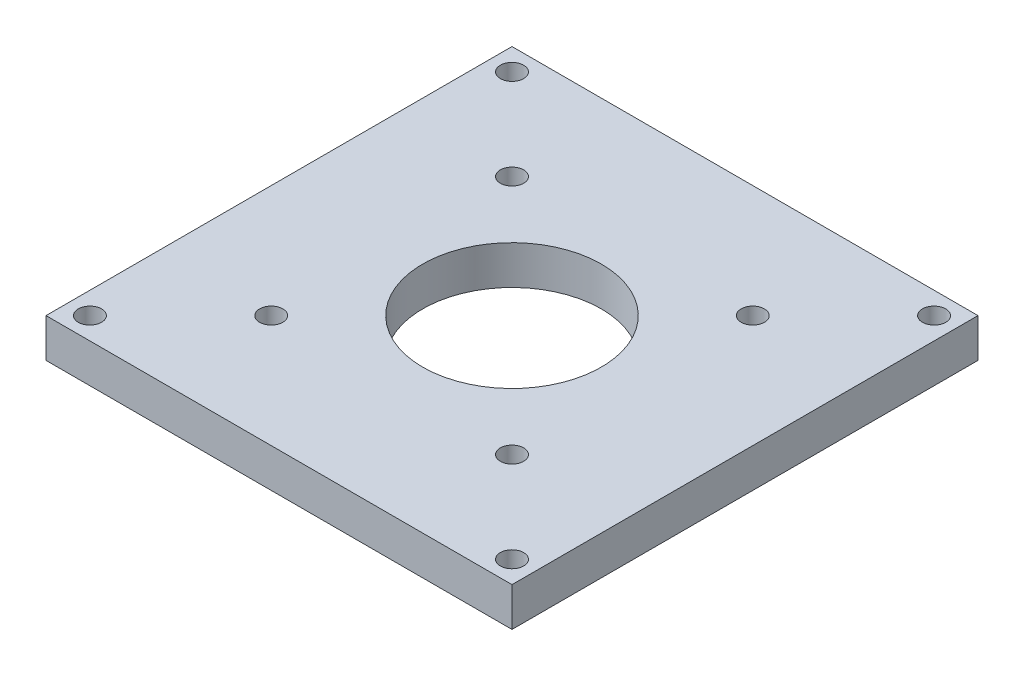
ISO-10303-21;
HEADER;
FILE_DESCRIPTION(('STEP AP214'),'2;1');
FILE_NAME('part.step','',(''),(''),'','','');
FILE_SCHEMA(('AUTOMOTIVE_DESIGN { 1 0 10303 214 1 1 1 1 }'));
ENDSEC;
DATA;
#1=APPLICATION_CONTEXT('core data for automotive mechanical design processes');
#2=APPLICATION_PROTOCOL_DEFINITION('international standard','automotive_design',2000,#1);
#3=PRODUCT_CONTEXT('',#1,'mechanical');
#4=PRODUCT('Part','Part','',(#3));
#5=PRODUCT_RELATED_PRODUCT_CATEGORY('part','',(#4));
#6=PRODUCT_DEFINITION_FORMATION('','',#4);
#7=PRODUCT_DEFINITION_CONTEXT('part definition',#1,'design');
#8=PRODUCT_DEFINITION('design','',#6,#7);
#9=PRODUCT_DEFINITION_SHAPE('','',#8);
#10=(LENGTH_UNIT() NAMED_UNIT(*) SI_UNIT(.MILLI.,.METRE.));
#11=(NAMED_UNIT(*) PLANE_ANGLE_UNIT() SI_UNIT($,.RADIAN.));
#12=(NAMED_UNIT(*) SI_UNIT($,.STERADIAN.) SOLID_ANGLE_UNIT());
#13=UNCERTAINTY_MEASURE_WITH_UNIT(LENGTH_MEASURE(1.E-05),#10,'distance_accuracy_value','');
#14=(GEOMETRIC_REPRESENTATION_CONTEXT(3) GLOBAL_UNCERTAINTY_ASSIGNED_CONTEXT((#13)) GLOBAL_UNIT_ASSIGNED_CONTEXT((#10,
#11,#12)) REPRESENTATION_CONTEXT('',''));
#15=CARTESIAN_POINT('',(0.,0.,0.));
#16=DIRECTION('',(0.,0.,1.));
#17=DIRECTION('',(1.,0.,0.));
#18=AXIS2_PLACEMENT_3D('',#15,#16,#17);
#19=CARTESIAN_POINT('',(0.,5.,0.));
#20=DIRECTION('',(1.,0.,0.));
#21=DIRECTION('',(0.,0.,-1.));
#22=AXIS2_PLACEMENT_3D('',#19,#20,#21);
#23=PLANE('',#22);
#24=DIRECTION('',(0.,0.,1.));
#25=VECTOR('',#24,1.);
#26=CARTESIAN_POINT('',(0.,0.,0.));
#27=LINE('',#26,#25);
#28=CARTESIAN_POINT('',(0.,0.,-60.));
#29=VERTEX_POINT('',#28);
#30=CARTESIAN_POINT('',(0.,0.,0.));
#31=VERTEX_POINT('',#30);
#32=EDGE_CURVE('E99',#29,#31,#27,.T.);
#33=ORIENTED_EDGE('',*,*,#32,.T.);
#34=DIRECTION('',(0.,-1.,0.));
#35=VECTOR('',#34,1.);
#36=CARTESIAN_POINT('',(0.,5.,0.));
#37=LINE('',#36,#35);
#38=CARTESIAN_POINT('',(0.,5.,0.));
#39=VERTEX_POINT('',#38);
#40=EDGE_CURVE('E11',#39,#31,#37,.T.);
#41=ORIENTED_EDGE('',*,*,#40,.F.);
#42=DIRECTION('',(0.,0.,1.));
#43=VECTOR('',#42,1.);
#44=CARTESIAN_POINT('',(0.,5.,0.));
#45=LINE('',#44,#43);
#46=CARTESIAN_POINT('',(0.,5.,-60.));
#47=VERTEX_POINT('',#46);
#48=EDGE_CURVE('E87',#47,#39,#45,.T.);
#49=ORIENTED_EDGE('',*,*,#48,.F.);
#50=DIRECTION('',(0.,-1.,0.));
#51=VECTOR('',#50,1.);
#52=CARTESIAN_POINT('',(0.,5.,-60.));
#53=LINE('',#52,#51);
#54=EDGE_CURVE('E95',#47,#29,#53,.T.);
#55=ORIENTED_EDGE('',*,*,#54,.T.);
#56=EDGE_LOOP('',(#33,#41,#49,#55));
#57=FACE_BOUND('',#56,.T.);
#58=ADVANCED_FACE('F36',(#57),#23,.F.);
#59=CARTESIAN_POINT('',(0.,5.,0.));
#60=DIRECTION('',(0.,0.,-1.));
#61=DIRECTION('',(-1.,0.,0.));
#62=AXIS2_PLACEMENT_3D('',#59,#60,#61);
#63=PLANE('',#62);
#64=DIRECTION('',(1.,0.,0.));
#65=VECTOR('',#64,1.);
#66=CARTESIAN_POINT('',(0.,0.,0.));
#67=LINE('',#66,#65);
#68=CARTESIAN_POINT('',(60.,0.,0.));
#69=VERTEX_POINT('',#68);
#70=EDGE_CURVE('E91',#31,#69,#67,.T.);
#71=ORIENTED_EDGE('',*,*,#70,.T.);
#72=DIRECTION('',(0.,-1.,0.));
#73=VECTOR('',#72,1.);
#74=CARTESIAN_POINT('',(60.,5.,0.));
#75=LINE('',#74,#73);
#76=CARTESIAN_POINT('',(60.,5.,0.));
#77=VERTEX_POINT('',#76);
#78=EDGE_CURVE('E44',#77,#69,#75,.T.);
#79=ORIENTED_EDGE('',*,*,#78,.F.);
#80=DIRECTION('',(1.,0.,0.));
#81=VECTOR('',#80,1.);
#82=CARTESIAN_POINT('',(0.,5.,0.));
#83=LINE('',#82,#81);
#84=EDGE_CURVE('E82',#39,#77,#83,.T.);
#85=ORIENTED_EDGE('',*,*,#84,.F.);
#86=ORIENTED_EDGE('',*,*,#40,.T.);
#87=EDGE_LOOP('',(#71,#79,#85,#86));
#88=FACE_BOUND('',#87,.T.);
#89=ADVANCED_FACE('F90',(#88),#63,.F.);
#90=CARTESIAN_POINT('',(60.,5.,0.));
#91=DIRECTION('',(-1.,0.,0.));
#92=DIRECTION('',(0.,0.,1.));
#93=AXIS2_PLACEMENT_3D('',#90,#91,#92);
#94=PLANE('',#93);
#95=DIRECTION('',(0.,0.,-1.));
#96=VECTOR('',#95,1.);
#97=CARTESIAN_POINT('',(60.,0.,0.));
#98=LINE('',#97,#96);
#99=CARTESIAN_POINT('',(60.,0.,-60.));
#100=VERTEX_POINT('',#99);
#101=EDGE_CURVE('E69',#69,#100,#98,.T.);
#102=ORIENTED_EDGE('',*,*,#101,.T.);
#103=DIRECTION('',(0.,-1.,0.));
#104=VECTOR('',#103,1.);
#105=CARTESIAN_POINT('',(60.,5.,-60.));
#106=LINE('',#105,#104);
#107=CARTESIAN_POINT('',(60.,5.,-60.));
#108=VERTEX_POINT('',#107);
#109=EDGE_CURVE('E92',#108,#100,#106,.T.);
#110=ORIENTED_EDGE('',*,*,#109,.F.);
#111=DIRECTION('',(0.,0.,-1.));
#112=VECTOR('',#111,1.);
#113=CARTESIAN_POINT('',(60.,5.,0.));
#114=LINE('',#113,#112);
#115=EDGE_CURVE('E85',#77,#108,#114,.T.);
#116=ORIENTED_EDGE('',*,*,#115,.F.);
#117=ORIENTED_EDGE('',*,*,#78,.T.);
#118=EDGE_LOOP('',(#102,#110,#116,#117));
#119=FACE_BOUND('',#118,.T.);
#120=ADVANCED_FACE('F93',(#119),#94,.F.);
#121=CARTESIAN_POINT('',(0.,5.,-60.));
#122=DIRECTION('',(0.,0.,1.));
#123=DIRECTION('',(1.,0.,0.));
#124=AXIS2_PLACEMENT_3D('',#121,#122,#123);
#125=PLANE('',#124);
#126=DIRECTION('',(-1.,0.,0.));
#127=VECTOR('',#126,1.);
#128=CARTESIAN_POINT('',(0.,0.,-60.));
#129=LINE('',#128,#127);
#130=EDGE_CURVE('E75',#100,#29,#129,.T.);
#131=ORIENTED_EDGE('',*,*,#130,.T.);
#132=ORIENTED_EDGE('',*,*,#54,.F.);
#133=DIRECTION('',(-1.,0.,0.));
#134=VECTOR('',#133,1.);
#135=CARTESIAN_POINT('',(0.,5.,-60.));
#136=LINE('',#135,#134);
#137=EDGE_CURVE('E52',#108,#47,#136,.T.);
#138=ORIENTED_EDGE('',*,*,#137,.F.);
#139=ORIENTED_EDGE('',*,*,#109,.T.);
#140=EDGE_LOOP('',(#131,#132,#138,#139));
#141=FACE_BOUND('',#140,.T.);
#142=ADVANCED_FACE('F107',(#141),#125,.F.);
#143=CARTESIAN_POINT('',(0.,5.,0.));
#144=DIRECTION('',(0.,-1.,0.));
#145=DIRECTION('',(0.,0.,-1.));
#146=AXIS2_PLACEMENT_3D('',#143,#144,#145);
#147=PLANE('',#146);
#148=CARTESIAN_POINT('',(14.5,5.,-45.5));
#149=DIRECTION('',(0.,1.,0.));
#150=DIRECTION('',(0.,0.,1.));
#151=AXIS2_PLACEMENT_3D('',#148,#149,#150);
#152=CIRCLE('',#151,1.5);
#153=CARTESIAN_POINT('',(14.5,5.,-44.));
#154=VERTEX_POINT('',#153);
#155=EDGE_CURVE('E138',#154,#154,#152,.T.);
#156=ORIENTED_EDGE('',*,*,#155,.F.);
#157=EDGE_LOOP('',(#156));
#158=FACE_BOUND('',#157,.T.);
#159=CARTESIAN_POINT('',(45.5,5.,-45.5));
#160=DIRECTION('',(0.,1.,0.));
#161=DIRECTION('',(0.,0.,1.));
#162=AXIS2_PLACEMENT_3D('',#159,#160,#161);
#163=CIRCLE('',#162,1.5);
#164=CARTESIAN_POINT('',(45.5,5.,-44.));
#165=VERTEX_POINT('',#164);
#166=EDGE_CURVE('E132',#165,#165,#163,.T.);
#167=ORIENTED_EDGE('',*,*,#166,.F.);
#168=EDGE_LOOP('',(#167));
#169=FACE_BOUND('',#168,.T.);
#170=CARTESIAN_POINT('',(45.5,5.,-14.5));
#171=DIRECTION('',(0.,1.,0.));
#172=DIRECTION('',(0.,0.,1.));
#173=AXIS2_PLACEMENT_3D('',#170,#171,#172);
#174=CIRCLE('',#173,1.5);
#175=CARTESIAN_POINT('',(45.5,5.,-13.));
#176=VERTEX_POINT('',#175);
#177=EDGE_CURVE('E126',#176,#176,#174,.T.);
#178=ORIENTED_EDGE('',*,*,#177,.F.);
#179=EDGE_LOOP('',(#178));
#180=FACE_BOUND('',#179,.T.);
#181=CARTESIAN_POINT('',(14.5,5.,-14.5));
#182=DIRECTION('',(0.,1.,0.));
#183=DIRECTION('',(0.,0.,1.));
#184=AXIS2_PLACEMENT_3D('',#181,#182,#183);
#185=CIRCLE('',#184,1.5);
#186=CARTESIAN_POINT('',(14.5,5.,-13.));
#187=VERTEX_POINT('',#186);
#188=EDGE_CURVE('E119',#187,#187,#185,.T.);
#189=ORIENTED_EDGE('',*,*,#188,.F.);
#190=EDGE_LOOP('',(#189));
#191=FACE_BOUND('',#190,.T.);
#192=CARTESIAN_POINT('',(2.82842712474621,5.,-57.1715728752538));
#193=DIRECTION('',(0.,1.,0.));
#194=DIRECTION('',(0.,0.,1.));
#195=AXIS2_PLACEMENT_3D('',#192,#193,#194);
#196=CIRCLE('',#195,1.49999999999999);
#197=CARTESIAN_POINT('',(2.82842712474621,5.,-55.6715728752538));
#198=VERTEX_POINT('',#197);
#199=EDGE_CURVE('E161',#198,#198,#196,.T.);
#200=ORIENTED_EDGE('',*,*,#199,.F.);
#201=EDGE_LOOP('',(#200));
#202=FACE_BOUND('',#201,.T.);
#203=CARTESIAN_POINT('',(57.1715728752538,5.,-57.1715728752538));
#204=DIRECTION('',(0.,1.,0.));
#205=DIRECTION('',(0.,0.,1.));
#206=AXIS2_PLACEMENT_3D('',#203,#204,#205);
#207=CIRCLE('',#206,1.5);
#208=CARTESIAN_POINT('',(57.1715728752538,5.,-55.6715728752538));
#209=VERTEX_POINT('',#208);
#210=EDGE_CURVE('E155',#209,#209,#207,.T.);
#211=ORIENTED_EDGE('',*,*,#210,.F.);
#212=EDGE_LOOP('',(#211));
#213=FACE_BOUND('',#212,.T.);
#214=CARTESIAN_POINT('',(57.1715728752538,5.,-2.82842712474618));
#215=DIRECTION('',(0.,1.,0.));
#216=DIRECTION('',(0.,0.,1.));
#217=AXIS2_PLACEMENT_3D('',#214,#215,#216);
#218=CIRCLE('',#217,1.5);
#219=CARTESIAN_POINT('',(57.1715728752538,5.,-1.32842712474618));
#220=VERTEX_POINT('',#219);
#221=EDGE_CURVE('E149',#220,#220,#218,.T.);
#222=ORIENTED_EDGE('',*,*,#221,.F.);
#223=EDGE_LOOP('',(#222));
#224=FACE_BOUND('',#223,.T.);
#225=CARTESIAN_POINT('',(2.82842712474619,5.,-2.82842712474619));
#226=DIRECTION('',(0.,1.,0.));
#227=DIRECTION('',(0.,0.,1.));
#228=AXIS2_PLACEMENT_3D('',#225,#226,#227);
#229=CIRCLE('',#228,1.5);
#230=CARTESIAN_POINT('',(2.82842712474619,5.,-1.32842712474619));
#231=VERTEX_POINT('',#230);
#232=EDGE_CURVE('E143',#231,#231,#229,.T.);
#233=ORIENTED_EDGE('',*,*,#232,.F.);
#234=EDGE_LOOP('',(#233));
#235=FACE_BOUND('',#234,.T.);
#236=CARTESIAN_POINT('',(30.,5.,-30.));
#237=DIRECTION('',(0.,1.,0.));
#238=DIRECTION('',(0.,0.,1.));
#239=AXIS2_PLACEMENT_3D('',#236,#237,#238);
#240=CIRCLE('',#239,11.5);
#241=CARTESIAN_POINT('',(30.,5.,-18.5));
#242=VERTEX_POINT('',#241);
#243=EDGE_CURVE('E113',#242,#242,#240,.T.);
#244=ORIENTED_EDGE('',*,*,#243,.F.);
#245=EDGE_LOOP('',(#244));
#246=FACE_BOUND('',#245,.T.);
#247=ORIENTED_EDGE('',*,*,#48,.T.);
#248=ORIENTED_EDGE('',*,*,#84,.T.);
#249=ORIENTED_EDGE('',*,*,#115,.T.);
#250=ORIENTED_EDGE('',*,*,#137,.T.);
#251=EDGE_LOOP('',(#247,#248,#249,#250));
#252=FACE_BOUND('',#251,.T.);
#253=ADVANCED_FACE('F83',(#158,#169,#180,#191,#202,#213,#224,#235,#246,#252),#147,.F.);
#254=CARTESIAN_POINT('',(0.,0.,0.));
#255=DIRECTION('',(0.,-1.,0.));
#256=DIRECTION('',(0.,0.,-1.));
#257=AXIS2_PLACEMENT_3D('',#254,#255,#256);
#258=PLANE('',#257);
#259=CARTESIAN_POINT('',(14.5,0.,-45.5));
#260=DIRECTION('',(0.,1.,0.));
#261=DIRECTION('',(0.,0.,1.));
#262=AXIS2_PLACEMENT_3D('',#259,#260,#261);
#263=CIRCLE('',#262,1.5);
#264=CARTESIAN_POINT('',(14.5,0.,-44.));
#265=VERTEX_POINT('',#264);
#266=EDGE_CURVE('E116',#265,#265,#263,.T.);
#267=ORIENTED_EDGE('',*,*,#266,.T.);
#268=EDGE_LOOP('',(#267));
#269=FACE_BOUND('',#268,.T.);
#270=CARTESIAN_POINT('',(45.5,0.,-45.5));
#271=DIRECTION('',(0.,1.,0.));
#272=DIRECTION('',(0.,0.,1.));
#273=AXIS2_PLACEMENT_3D('',#270,#271,#272);
#274=CIRCLE('',#273,1.5);
#275=CARTESIAN_POINT('',(45.5,0.,-44.));
#276=VERTEX_POINT('',#275);
#277=EDGE_CURVE('E135',#276,#276,#274,.T.);
#278=ORIENTED_EDGE('',*,*,#277,.T.);
#279=EDGE_LOOP('',(#278));
#280=FACE_BOUND('',#279,.T.);
#281=CARTESIAN_POINT('',(45.5,0.,-14.5));
#282=DIRECTION('',(0.,1.,0.));
#283=DIRECTION('',(0.,0.,1.));
#284=AXIS2_PLACEMENT_3D('',#281,#282,#283);
#285=CIRCLE('',#284,1.5);
#286=CARTESIAN_POINT('',(45.5,0.,-13.));
#287=VERTEX_POINT('',#286);
#288=EDGE_CURVE('E129',#287,#287,#285,.T.);
#289=ORIENTED_EDGE('',*,*,#288,.T.);
#290=EDGE_LOOP('',(#289));
#291=FACE_BOUND('',#290,.T.);
#292=CARTESIAN_POINT('',(14.5,0.,-14.5));
#293=DIRECTION('',(0.,1.,0.));
#294=DIRECTION('',(0.,0.,1.));
#295=AXIS2_PLACEMENT_3D('',#292,#293,#294);
#296=CIRCLE('',#295,1.5);
#297=CARTESIAN_POINT('',(14.5,0.,-13.));
#298=VERTEX_POINT('',#297);
#299=EDGE_CURVE('E122',#298,#298,#296,.T.);
#300=ORIENTED_EDGE('',*,*,#299,.T.);
#301=EDGE_LOOP('',(#300));
#302=FACE_BOUND('',#301,.T.);
#303=CARTESIAN_POINT('',(2.82842712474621,0.,-57.1715728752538));
#304=DIRECTION('',(0.,1.,0.));
#305=DIRECTION('',(0.,0.,1.));
#306=AXIS2_PLACEMENT_3D('',#303,#304,#305);
#307=CIRCLE('',#306,1.49999999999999);
#308=CARTESIAN_POINT('',(2.82842712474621,0.,-55.6715728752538));
#309=VERTEX_POINT('',#308);
#310=EDGE_CURVE('E123',#309,#309,#307,.T.);
#311=ORIENTED_EDGE('',*,*,#310,.T.);
#312=EDGE_LOOP('',(#311));
#313=FACE_BOUND('',#312,.T.);
#314=CARTESIAN_POINT('',(57.1715728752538,0.,-57.1715728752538));
#315=DIRECTION('',(0.,1.,0.));
#316=DIRECTION('',(0.,0.,1.));
#317=AXIS2_PLACEMENT_3D('',#314,#315,#316);
#318=CIRCLE('',#317,1.5);
#319=CARTESIAN_POINT('',(57.1715728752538,0.,-55.6715728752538));
#320=VERTEX_POINT('',#319);
#321=EDGE_CURVE('E158',#320,#320,#318,.T.);
#322=ORIENTED_EDGE('',*,*,#321,.T.);
#323=EDGE_LOOP('',(#322));
#324=FACE_BOUND('',#323,.T.);
#325=CARTESIAN_POINT('',(57.1715728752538,0.,-2.82842712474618));
#326=DIRECTION('',(0.,1.,0.));
#327=DIRECTION('',(0.,0.,1.));
#328=AXIS2_PLACEMENT_3D('',#325,#326,#327);
#329=CIRCLE('',#328,1.5);
#330=CARTESIAN_POINT('',(57.1715728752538,0.,-1.32842712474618));
#331=VERTEX_POINT('',#330);
#332=EDGE_CURVE('E152',#331,#331,#329,.T.);
#333=ORIENTED_EDGE('',*,*,#332,.T.);
#334=EDGE_LOOP('',(#333));
#335=FACE_BOUND('',#334,.T.);
#336=CARTESIAN_POINT('',(2.82842712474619,0.,-2.82842712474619));
#337=DIRECTION('',(0.,1.,0.));
#338=DIRECTION('',(0.,0.,1.));
#339=AXIS2_PLACEMENT_3D('',#336,#337,#338);
#340=CIRCLE('',#339,1.5);
#341=CARTESIAN_POINT('',(2.82842712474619,0.,-1.32842712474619));
#342=VERTEX_POINT('',#341);
#343=EDGE_CURVE('E146',#342,#342,#340,.T.);
#344=ORIENTED_EDGE('',*,*,#343,.T.);
#345=EDGE_LOOP('',(#344));
#346=FACE_BOUND('',#345,.T.);
#347=CARTESIAN_POINT('',(30.,0.,-30.));
#348=DIRECTION('',(0.,1.,0.));
#349=DIRECTION('',(0.,0.,1.));
#350=AXIS2_PLACEMENT_3D('',#347,#348,#349);
#351=CIRCLE('',#350,11.5);
#352=CARTESIAN_POINT('',(30.,0.,-18.5));
#353=VERTEX_POINT('',#352);
#354=EDGE_CURVE('E102',#353,#353,#351,.T.);
#355=ORIENTED_EDGE('',*,*,#354,.T.);
#356=EDGE_LOOP('',(#355));
#357=FACE_BOUND('',#356,.T.);
#358=ORIENTED_EDGE('',*,*,#32,.F.);
#359=ORIENTED_EDGE('',*,*,#130,.F.);
#360=ORIENTED_EDGE('',*,*,#101,.F.);
#361=ORIENTED_EDGE('',*,*,#70,.F.);
#362=EDGE_LOOP('',(#358,#359,#360,#361));
#363=FACE_BOUND('',#362,.T.);
#364=ADVANCED_FACE('F110',(#269,#280,#291,#302,#313,#324,#335,#346,#357,#363),#258,.T.);
#365=CARTESIAN_POINT('',(30.,0.,-30.));
#366=DIRECTION('',(0.,1.,0.));
#367=DIRECTION('',(0.,0.,1.));
#368=AXIS2_PLACEMENT_3D('',#365,#366,#367);
#369=CYLINDRICAL_SURFACE('',#368,11.5);
#370=ORIENTED_EDGE('',*,*,#354,.F.);
#371=EDGE_LOOP('',(#370));
#372=FACE_BOUND('',#371,.T.);
#373=ORIENTED_EDGE('',*,*,#243,.T.);
#374=EDGE_LOOP('',(#373));
#375=FACE_BOUND('',#374,.T.);
#376=ADVANCED_FACE('F189',(#372,#375),#369,.F.);
#377=CARTESIAN_POINT('',(2.82842712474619,0.,-2.82842712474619));
#378=DIRECTION('',(0.,1.,0.));
#379=DIRECTION('',(0.,0.,1.));
#380=AXIS2_PLACEMENT_3D('',#377,#378,#379);
#381=CYLINDRICAL_SURFACE('',#380,1.5);
#382=ORIENTED_EDGE('',*,*,#343,.F.);
#383=EDGE_LOOP('',(#382));
#384=FACE_BOUND('',#383,.T.);
#385=ORIENTED_EDGE('',*,*,#232,.T.);
#386=EDGE_LOOP('',(#385));
#387=FACE_BOUND('',#386,.T.);
#388=ADVANCED_FACE('F191',(#384,#387),#381,.F.);
#389=CARTESIAN_POINT('',(57.1715728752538,0.,-2.82842712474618));
#390=DIRECTION('',(0.,1.,0.));
#391=DIRECTION('',(0.,0.,1.));
#392=AXIS2_PLACEMENT_3D('',#389,#390,#391);
#393=CYLINDRICAL_SURFACE('',#392,1.5);
#394=ORIENTED_EDGE('',*,*,#332,.F.);
#395=EDGE_LOOP('',(#394));
#396=FACE_BOUND('',#395,.T.);
#397=ORIENTED_EDGE('',*,*,#221,.T.);
#398=EDGE_LOOP('',(#397));
#399=FACE_BOUND('',#398,.T.);
#400=ADVANCED_FACE('F198',(#396,#399),#393,.F.);
#401=CARTESIAN_POINT('',(57.1715728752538,0.,-57.1715728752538));
#402=DIRECTION('',(0.,1.,0.));
#403=DIRECTION('',(0.,0.,1.));
#404=AXIS2_PLACEMENT_3D('',#401,#402,#403);
#405=CYLINDRICAL_SURFACE('',#404,1.5);
#406=ORIENTED_EDGE('',*,*,#321,.F.);
#407=EDGE_LOOP('',(#406));
#408=FACE_BOUND('',#407,.T.);
#409=ORIENTED_EDGE('',*,*,#210,.T.);
#410=EDGE_LOOP('',(#409));
#411=FACE_BOUND('',#410,.T.);
#412=ADVANCED_FACE('F173',(#408,#411),#405,.F.);
#413=CARTESIAN_POINT('',(2.82842712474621,0.,-57.1715728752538));
#414=DIRECTION('',(0.,1.,0.));
#415=DIRECTION('',(0.,0.,1.));
#416=AXIS2_PLACEMENT_3D('',#413,#414,#415);
#417=CYLINDRICAL_SURFACE('',#416,1.49999999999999);
#418=ORIENTED_EDGE('',*,*,#310,.F.);
#419=EDGE_LOOP('',(#418));
#420=FACE_BOUND('',#419,.T.);
#421=ORIENTED_EDGE('',*,*,#199,.T.);
#422=EDGE_LOOP('',(#421));
#423=FACE_BOUND('',#422,.T.);
#424=ADVANCED_FACE('F169',(#420,#423),#417,.F.);
#425=CARTESIAN_POINT('',(14.5,0.,-14.5));
#426=DIRECTION('',(0.,1.,0.));
#427=DIRECTION('',(0.,0.,1.));
#428=AXIS2_PLACEMENT_3D('',#425,#426,#427);
#429=CYLINDRICAL_SURFACE('',#428,1.5);
#430=ORIENTED_EDGE('',*,*,#299,.F.);
#431=EDGE_LOOP('',(#430));
#432=FACE_BOUND('',#431,.T.);
#433=ORIENTED_EDGE('',*,*,#188,.T.);
#434=EDGE_LOOP('',(#433));
#435=FACE_BOUND('',#434,.T.);
#436=ADVANCED_FACE('F172',(#432,#435),#429,.F.);
#437=CARTESIAN_POINT('',(45.5,0.,-14.5));
#438=DIRECTION('',(0.,1.,0.));
#439=DIRECTION('',(0.,0.,1.));
#440=AXIS2_PLACEMENT_3D('',#437,#438,#439);
#441=CYLINDRICAL_SURFACE('',#440,1.5);
#442=ORIENTED_EDGE('',*,*,#288,.F.);
#443=EDGE_LOOP('',(#442));
#444=FACE_BOUND('',#443,.T.);
#445=ORIENTED_EDGE('',*,*,#177,.T.);
#446=EDGE_LOOP('',(#445));
#447=FACE_BOUND('',#446,.T.);
#448=ADVANCED_FACE('F270',(#444,#447),#441,.F.);
#449=CARTESIAN_POINT('',(45.5,0.,-45.5));
#450=DIRECTION('',(0.,1.,0.));
#451=DIRECTION('',(0.,0.,1.));
#452=AXIS2_PLACEMENT_3D('',#449,#450,#451);
#453=CYLINDRICAL_SURFACE('',#452,1.5);
#454=ORIENTED_EDGE('',*,*,#277,.F.);
#455=EDGE_LOOP('',(#454));
#456=FACE_BOUND('',#455,.T.);
#457=ORIENTED_EDGE('',*,*,#166,.T.);
#458=EDGE_LOOP('',(#457));
#459=FACE_BOUND('',#458,.T.);
#460=ADVANCED_FACE('F279',(#456,#459),#453,.F.);
#461=CARTESIAN_POINT('',(14.5,0.,-45.5));
#462=DIRECTION('',(0.,1.,0.));
#463=DIRECTION('',(0.,0.,1.));
#464=AXIS2_PLACEMENT_3D('',#461,#462,#463);
#465=CYLINDRICAL_SURFACE('',#464,1.5);
#466=ORIENTED_EDGE('',*,*,#266,.F.);
#467=EDGE_LOOP('',(#466));
#468=FACE_BOUND('',#467,.T.);
#469=ORIENTED_EDGE('',*,*,#155,.T.);
#470=EDGE_LOOP('',(#469));
#471=FACE_BOUND('',#470,.T.);
#472=ADVANCED_FACE('F289',(#468,#471),#465,.F.);
#473=CLOSED_SHELL('',(#58,#89,#120,#142,#253,#364,#376,#388,#400,#412,#424,#436,#448,#460,#472));
#474=MANIFOLD_SOLID_BREP('B2',#473);
#475=ADVANCED_BREP_SHAPE_REPRESENTATION('',(#18,#474),#14);
#476=SHAPE_DEFINITION_REPRESENTATION(#9,#475);
ENDSEC;
END-ISO-10303-21;
